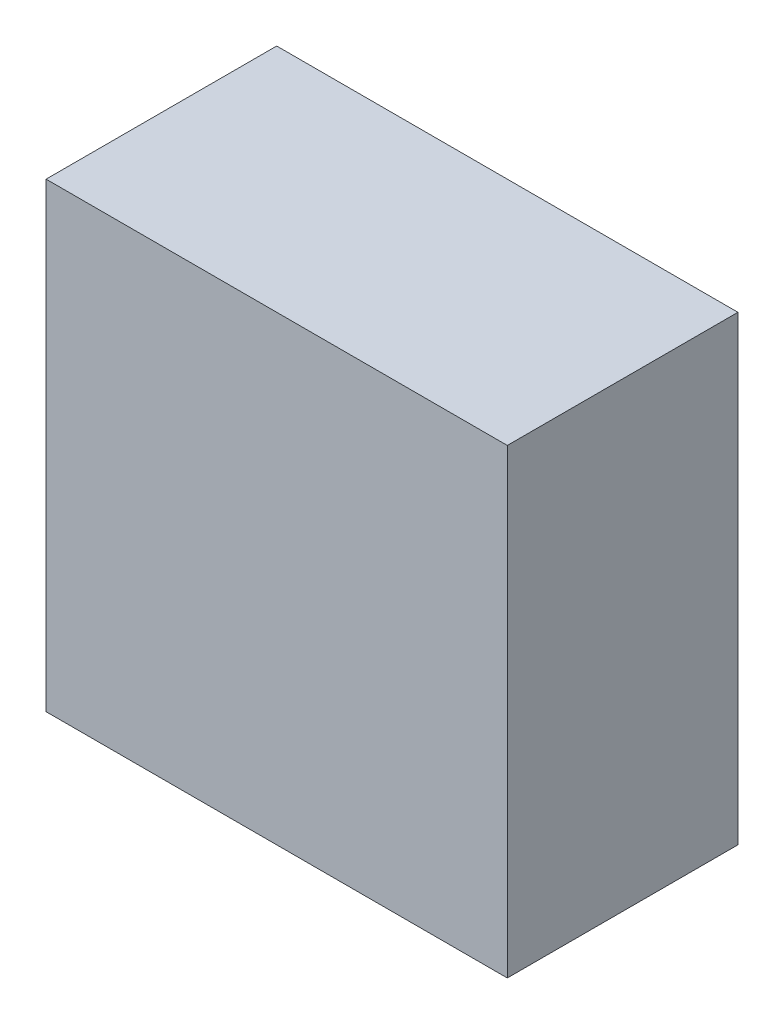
from build123d import *

# Parameters (mm, degrees)
ESQUISSE1_W          = 50
ESQUISSE1_H          = 50
BASE_EXTRUSION_DEPTH = 25


with BuildPart() as part:
    # Esquisse1 → Base-Extrusion (new body)
    with BuildSketch(Plane.XY):
        with Locations((1476.555847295, -200)):
            Rectangle(ESQUISSE1_W, ESQUISSE1_H)
    extrude(amount=BASE_EXTRUSION_DEPTH)


solid = part.part
